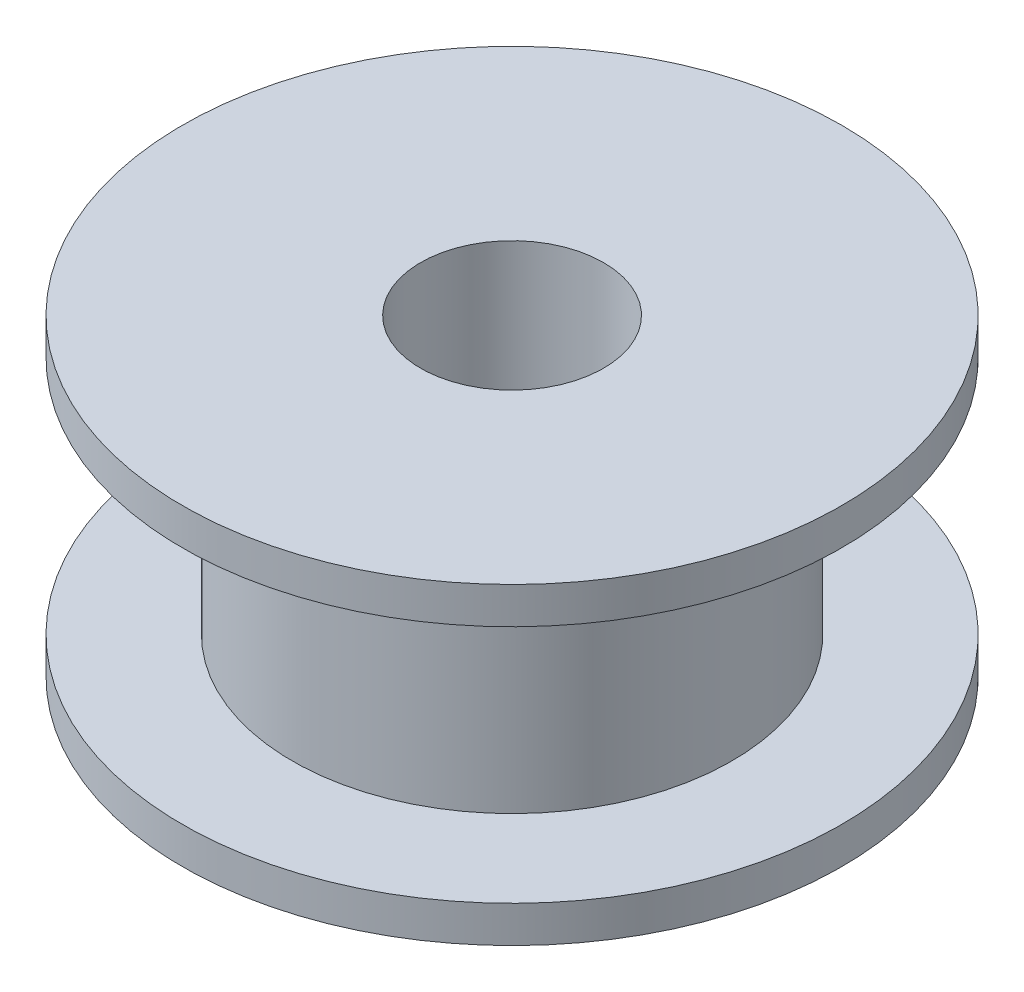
ISO-10303-21;
HEADER;
FILE_DESCRIPTION(('STEP AP214'),'2;1');
FILE_NAME('part.step','',(''),(''),'','','');
FILE_SCHEMA(('AUTOMOTIVE_DESIGN { 1 0 10303 214 1 1 1 1 }'));
ENDSEC;
DATA;
#1=APPLICATION_CONTEXT('core data for automotive mechanical design processes');
#2=APPLICATION_PROTOCOL_DEFINITION('international standard','automotive_design',2000,#1);
#3=PRODUCT_CONTEXT('',#1,'mechanical');
#4=PRODUCT('Part','Part','',(#3));
#5=PRODUCT_RELATED_PRODUCT_CATEGORY('part','',(#4));
#6=PRODUCT_DEFINITION_FORMATION('','',#4);
#7=PRODUCT_DEFINITION_CONTEXT('part definition',#1,'design');
#8=PRODUCT_DEFINITION('design','',#6,#7);
#9=PRODUCT_DEFINITION_SHAPE('','',#8);
#10=(LENGTH_UNIT() NAMED_UNIT(*) SI_UNIT(.MILLI.,.METRE.));
#11=(NAMED_UNIT(*) PLANE_ANGLE_UNIT() SI_UNIT($,.RADIAN.));
#12=(NAMED_UNIT(*) SI_UNIT($,.STERADIAN.) SOLID_ANGLE_UNIT());
#13=UNCERTAINTY_MEASURE_WITH_UNIT(LENGTH_MEASURE(1.E-05),#10,'distance_accuracy_value','');
#14=(GEOMETRIC_REPRESENTATION_CONTEXT(3) GLOBAL_UNCERTAINTY_ASSIGNED_CONTEXT((#13)) GLOBAL_UNIT_ASSIGNED_CONTEXT((#10,
#11,#12)) REPRESENTATION_CONTEXT('',''));
#15=CARTESIAN_POINT('',(0.,0.,0.));
#16=DIRECTION('',(0.,0.,1.));
#17=DIRECTION('',(1.,0.,0.));
#18=AXIS2_PLACEMENT_3D('',#15,#16,#17);
#19=CARTESIAN_POINT('',(9.,0.,0.));
#20=DIRECTION('',(0.,-1.,0.));
#21=DIRECTION('',(0.,0.,-1.));
#22=AXIS2_PLACEMENT_3D('',#19,#20,#21);
#23=PLANE('',#22);
#24=CARTESIAN_POINT('',(0.,0.,0.));
#25=DIRECTION('',(0.,-1.,0.));
#26=DIRECTION('',(0.,0.,-1.));
#27=AXIS2_PLACEMENT_3D('',#24,#25,#26);
#28=CIRCLE('',#27,9.);
#29=CARTESIAN_POINT('',(0.,0.,-9.));
#30=VERTEX_POINT('',#29);
#31=EDGE_CURVE('E61',#30,#30,#28,.T.);
#32=ORIENTED_EDGE('',*,*,#31,.T.);
#33=EDGE_LOOP('',(#32));
#34=FACE_BOUND('',#33,.T.);
#35=CARTESIAN_POINT('',(0.,0.,0.));
#36=DIRECTION('',(0.,-1.,0.));
#37=DIRECTION('',(0.,0.,-1.));
#38=AXIS2_PLACEMENT_3D('',#35,#36,#37);
#39=CIRCLE('',#38,2.5);
#40=CARTESIAN_POINT('',(0.,0.,-2.5));
#41=VERTEX_POINT('',#40);
#42=EDGE_CURVE('E10',#41,#41,#39,.T.);
#43=ORIENTED_EDGE('',*,*,#42,.F.);
#44=EDGE_LOOP('',(#43));
#45=FACE_BOUND('',#44,.T.);
#46=ADVANCED_FACE('F33',(#34,#45),#23,.T.);
#47=CARTESIAN_POINT('',(0.,0.,0.));
#48=DIRECTION('',(0.,-1.,0.));
#49=DIRECTION('',(0.,0.,-1.));
#50=AXIS2_PLACEMENT_3D('',#47,#48,#49);
#51=CYLINDRICAL_SURFACE('',#50,2.5);
#52=ORIENTED_EDGE('',*,*,#42,.T.);
#53=EDGE_LOOP('',(#52));
#54=FACE_BOUND('',#53,.T.);
#55=CARTESIAN_POINT('',(0.,8.54,0.));
#56=DIRECTION('',(0.,-1.,0.));
#57=DIRECTION('',(0.,0.,-1.));
#58=AXIS2_PLACEMENT_3D('',#55,#56,#57);
#59=CIRCLE('',#58,2.5);
#60=CARTESIAN_POINT('',(0.,8.54,-2.5));
#61=VERTEX_POINT('',#60);
#62=EDGE_CURVE('E39',#61,#61,#59,.T.);
#63=ORIENTED_EDGE('',*,*,#62,.F.);
#64=EDGE_LOOP('',(#63));
#65=FACE_BOUND('',#64,.T.);
#66=ADVANCED_FACE('F79',(#54,#65),#51,.F.);
#67=CARTESIAN_POINT('',(2.5,8.54,0.));
#68=DIRECTION('',(0.,1.,0.));
#69=DIRECTION('',(0.,0.,1.));
#70=AXIS2_PLACEMENT_3D('',#67,#68,#69);
#71=PLANE('',#70);
#72=ORIENTED_EDGE('',*,*,#62,.T.);
#73=EDGE_LOOP('',(#72));
#74=FACE_BOUND('',#73,.T.);
#75=CARTESIAN_POINT('',(0.,8.54,0.));
#76=DIRECTION('',(0.,-1.,0.));
#77=DIRECTION('',(0.,0.,-1.));
#78=AXIS2_PLACEMENT_3D('',#75,#76,#77);
#79=CIRCLE('',#78,9.);
#80=CARTESIAN_POINT('',(0.,8.54,-9.));
#81=VERTEX_POINT('',#80);
#82=EDGE_CURVE('E43',#81,#81,#79,.T.);
#83=ORIENTED_EDGE('',*,*,#82,.F.);
#84=EDGE_LOOP('',(#83));
#85=FACE_BOUND('',#84,.T.);
#86=ADVANCED_FACE('F83',(#74,#85),#71,.T.);
#87=CARTESIAN_POINT('',(0.,0.,0.));
#88=DIRECTION('',(0.,-1.,0.));
#89=DIRECTION('',(0.,0.,-1.));
#90=AXIS2_PLACEMENT_3D('',#87,#88,#89);
#91=CYLINDRICAL_SURFACE('',#90,9.);
#92=ORIENTED_EDGE('',*,*,#82,.T.);
#93=EDGE_LOOP('',(#92));
#94=FACE_BOUND('',#93,.T.);
#95=CARTESIAN_POINT('',(0.,7.54,0.));
#96=DIRECTION('',(0.,-1.,0.));
#97=DIRECTION('',(0.,0.,-1.));
#98=AXIS2_PLACEMENT_3D('',#95,#96,#97);
#99=CIRCLE('',#98,9.);
#100=CARTESIAN_POINT('',(0.,7.54,-9.));
#101=VERTEX_POINT('',#100);
#102=EDGE_CURVE('E47',#101,#101,#99,.T.);
#103=ORIENTED_EDGE('',*,*,#102,.F.);
#104=EDGE_LOOP('',(#103));
#105=FACE_BOUND('',#104,.T.);
#106=ADVANCED_FACE('F87',(#94,#105),#91,.T.);
#107=CARTESIAN_POINT('',(9.,7.54,0.));
#108=DIRECTION('',(0.,-1.,0.));
#109=DIRECTION('',(0.,0.,-1.));
#110=AXIS2_PLACEMENT_3D('',#107,#108,#109);
#111=PLANE('',#110);
#112=ORIENTED_EDGE('',*,*,#102,.T.);
#113=EDGE_LOOP('',(#112));
#114=FACE_BOUND('',#113,.T.);
#115=CARTESIAN_POINT('',(0.,7.54,0.));
#116=DIRECTION('',(0.,-1.,0.));
#117=DIRECTION('',(0.,0.,-1.));
#118=AXIS2_PLACEMENT_3D('',#115,#116,#117);
#119=CIRCLE('',#118,6.);
#120=CARTESIAN_POINT('',(0.,7.54,-6.));
#121=VERTEX_POINT('',#120);
#122=EDGE_CURVE('E52',#121,#121,#119,.T.);
#123=ORIENTED_EDGE('',*,*,#122,.F.);
#124=EDGE_LOOP('',(#123));
#125=FACE_BOUND('',#124,.T.);
#126=ADVANCED_FACE('F93',(#114,#125),#111,.T.);
#127=CARTESIAN_POINT('',(0.,0.,0.));
#128=DIRECTION('',(0.,-1.,0.));
#129=DIRECTION('',(0.,0.,-1.));
#130=AXIS2_PLACEMENT_3D('',#127,#128,#129);
#131=CYLINDRICAL_SURFACE('',#130,6.);
#132=ORIENTED_EDGE('',*,*,#122,.T.);
#133=EDGE_LOOP('',(#132));
#134=FACE_BOUND('',#133,.T.);
#135=CARTESIAN_POINT('',(0.,1.,0.));
#136=DIRECTION('',(0.,-1.,0.));
#137=DIRECTION('',(0.,0.,-1.));
#138=AXIS2_PLACEMENT_3D('',#135,#136,#137);
#139=CIRCLE('',#138,6.);
#140=CARTESIAN_POINT('',(0.,1.,-6.));
#141=VERTEX_POINT('',#140);
#142=EDGE_CURVE('E55',#141,#141,#139,.T.);
#143=ORIENTED_EDGE('',*,*,#142,.F.);
#144=EDGE_LOOP('',(#143));
#145=FACE_BOUND('',#144,.T.);
#146=ADVANCED_FACE('F75',(#134,#145),#131,.T.);
#147=CARTESIAN_POINT('',(6.,1.,0.));
#148=DIRECTION('',(0.,1.,0.));
#149=DIRECTION('',(0.,0.,1.));
#150=AXIS2_PLACEMENT_3D('',#147,#148,#149);
#151=PLANE('',#150);
#152=ORIENTED_EDGE('',*,*,#142,.T.);
#153=EDGE_LOOP('',(#152));
#154=FACE_BOUND('',#153,.T.);
#155=CARTESIAN_POINT('',(0.,1.,0.));
#156=DIRECTION('',(0.,-1.,0.));
#157=DIRECTION('',(0.,0.,-1.));
#158=AXIS2_PLACEMENT_3D('',#155,#156,#157);
#159=CIRCLE('',#158,9.);
#160=CARTESIAN_POINT('',(0.,1.,-9.));
#161=VERTEX_POINT('',#160);
#162=EDGE_CURVE('E58',#161,#161,#159,.T.);
#163=ORIENTED_EDGE('',*,*,#162,.F.);
#164=EDGE_LOOP('',(#163));
#165=FACE_BOUND('',#164,.T.);
#166=ADVANCED_FACE('F69',(#154,#165),#151,.T.);
#167=CARTESIAN_POINT('',(0.,0.,0.));
#168=DIRECTION('',(0.,-1.,0.));
#169=DIRECTION('',(0.,0.,-1.));
#170=AXIS2_PLACEMENT_3D('',#167,#168,#169);
#171=CYLINDRICAL_SURFACE('',#170,9.);
#172=ORIENTED_EDGE('',*,*,#162,.T.);
#173=EDGE_LOOP('',(#172));
#174=FACE_BOUND('',#173,.T.);
#175=ORIENTED_EDGE('',*,*,#31,.F.);
#176=EDGE_LOOP('',(#175));
#177=FACE_BOUND('',#176,.T.);
#178=ADVANCED_FACE('F67',(#174,#177),#171,.T.);
#179=CLOSED_SHELL('',(#46,#66,#86,#106,#126,#146,#166,#178));
#180=MANIFOLD_SOLID_BREP('B2',#179);
#181=ADVANCED_BREP_SHAPE_REPRESENTATION('',(#18,#180),#14);
#182=SHAPE_DEFINITION_REPRESENTATION(#9,#181);
ENDSEC;
END-ISO-10303-21;
